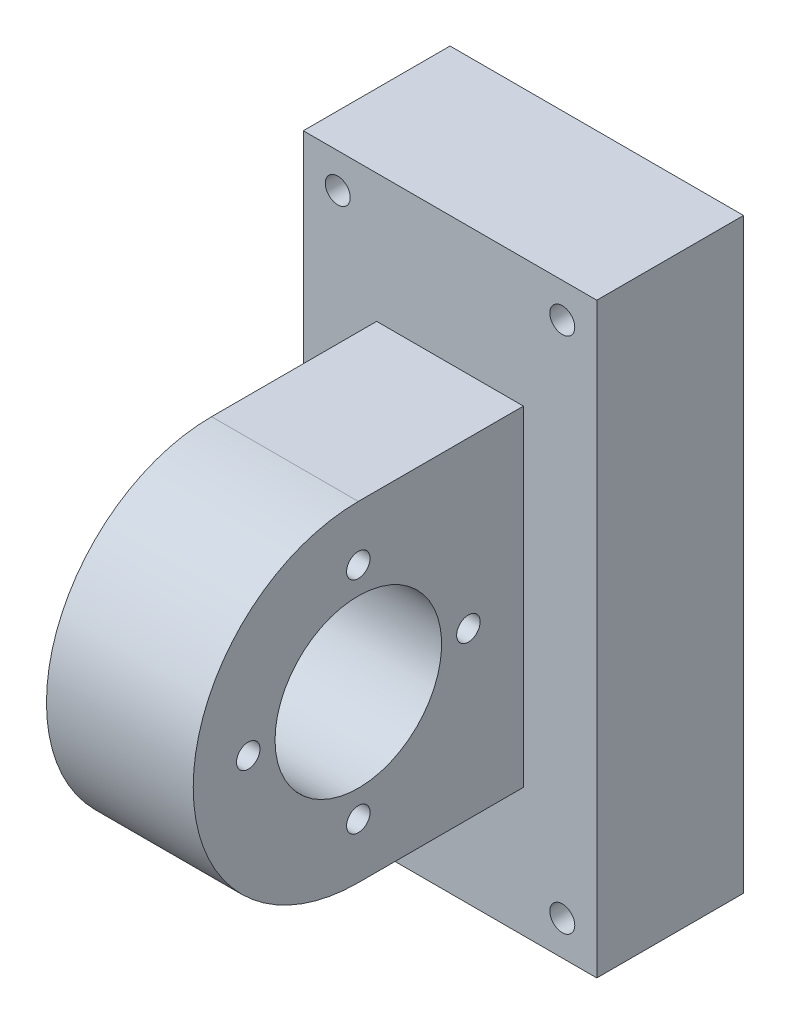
ISO-10303-21;
HEADER;
FILE_DESCRIPTION(('STEP AP214'),'2;1');
FILE_NAME('part.step','',(''),(''),'','','');
FILE_SCHEMA(('AUTOMOTIVE_DESIGN { 1 0 10303 214 1 1 1 1 }'));
ENDSEC;
DATA;
#1=APPLICATION_CONTEXT('core data for automotive mechanical design processes');
#2=APPLICATION_PROTOCOL_DEFINITION('international standard','automotive_design',2000,#1);
#3=PRODUCT_CONTEXT('',#1,'mechanical');
#4=PRODUCT('Part','Part','',(#3));
#5=PRODUCT_RELATED_PRODUCT_CATEGORY('part','',(#4));
#6=PRODUCT_DEFINITION_FORMATION('','',#4);
#7=PRODUCT_DEFINITION_CONTEXT('part definition',#1,'design');
#8=PRODUCT_DEFINITION('design','',#6,#7);
#9=PRODUCT_DEFINITION_SHAPE('','',#8);
#10=(LENGTH_UNIT() NAMED_UNIT(*) SI_UNIT(.MILLI.,.METRE.));
#11=(NAMED_UNIT(*) PLANE_ANGLE_UNIT() SI_UNIT($,.RADIAN.));
#12=(NAMED_UNIT(*) SI_UNIT($,.STERADIAN.) SOLID_ANGLE_UNIT());
#13=UNCERTAINTY_MEASURE_WITH_UNIT(LENGTH_MEASURE(1.E-05),#10,'distance_accuracy_value','');
#14=(GEOMETRIC_REPRESENTATION_CONTEXT(3) GLOBAL_UNCERTAINTY_ASSIGNED_CONTEXT((#13)) GLOBAL_UNIT_ASSIGNED_CONTEXT((#10,
#11,#12)) REPRESENTATION_CONTEXT('',''));
#15=CARTESIAN_POINT('',(0.,0.,0.));
#16=DIRECTION('',(0.,0.,1.));
#17=DIRECTION('',(1.,0.,0.));
#18=AXIS2_PLACEMENT_3D('',#15,#16,#17);
#19=CARTESIAN_POINT('',(0.,0.,20.));
#20=DIRECTION('',(0.,0.,-1.));
#21=DIRECTION('',(-1.,0.,0.));
#22=AXIS2_PLACEMENT_3D('',#19,#20,#21);
#23=PLANE('',#22);
#24=DIRECTION('',(0.,1.,0.));
#25=VECTOR('',#24,1.);
#26=CARTESIAN_POINT('',(10.,-40.,20.));
#27=LINE('',#26,#25);
#28=CARTESIAN_POINT('',(10.,-40.,20.));
#29=VERTEX_POINT('',#28);
#30=CARTESIAN_POINT('',(10.,40.,20.));
#31=VERTEX_POINT('',#30);
#32=EDGE_CURVE('E84',#29,#31,#27,.T.);
#33=ORIENTED_EDGE('',*,*,#32,.T.);
#34=DIRECTION('',(-1.,0.,0.));
#35=VECTOR('',#34,1.);
#36=CARTESIAN_POINT('',(-10.,40.,20.));
#37=LINE('',#36,#35);
#38=CARTESIAN_POINT('',(-30.,40.,20.));
#39=VERTEX_POINT('',#38);
#40=EDGE_CURVE('E101',#31,#39,#37,.T.);
#41=ORIENTED_EDGE('',*,*,#40,.T.);
#42=DIRECTION('',(0.,1.,0.));
#43=VECTOR('',#42,1.);
#44=CARTESIAN_POINT('',(-30.,-40.,20.));
#45=LINE('',#44,#43);
#46=CARTESIAN_POINT('',(-30.,-40.,20.));
#47=VERTEX_POINT('',#46);
#48=EDGE_CURVE('E117',#47,#39,#45,.T.);
#49=ORIENTED_EDGE('',*,*,#48,.F.);
#50=DIRECTION('',(1.,0.,0.));
#51=VECTOR('',#50,1.);
#52=CARTESIAN_POINT('',(-10.,-40.,20.));
#53=LINE('',#52,#51);
#54=EDGE_CURVE('E59',#47,#29,#53,.T.);
#55=ORIENTED_EDGE('',*,*,#54,.T.);
#56=EDGE_LOOP('',(#33,#41,#49,#55));
#57=FACE_BOUND('',#56,.T.);
#58=CARTESIAN_POINT('',(5.3,35.3,20.));
#59=DIRECTION('',(0.,0.,1.));
#60=DIRECTION('',(1.,0.,0.));
#61=AXIS2_PLACEMENT_3D('',#58,#59,#60);
#62=CIRCLE('',#61,1.7);
#63=CARTESIAN_POINT('',(7.,35.3,20.));
#64=VERTEX_POINT('',#63);
#65=EDGE_CURVE('E97',#64,#64,#62,.T.);
#66=ORIENTED_EDGE('',*,*,#65,.F.);
#67=EDGE_LOOP('',(#66));
#68=FACE_BOUND('',#67,.T.);
#69=CARTESIAN_POINT('',(5.3,-35.3,20.));
#70=DIRECTION('',(0.,0.,-1.));
#71=DIRECTION('',(1.,0.,0.));
#72=AXIS2_PLACEMENT_3D('',#69,#70,#71);
#73=CIRCLE('',#72,1.7);
#74=CARTESIAN_POINT('',(7.,-35.3,20.));
#75=VERTEX_POINT('',#74);
#76=EDGE_CURVE('E108',#75,#75,#73,.T.);
#77=ORIENTED_EDGE('',*,*,#76,.T.);
#78=EDGE_LOOP('',(#77));
#79=FACE_BOUND('',#78,.T.);
#80=CARTESIAN_POINT('',(-25.3,-35.3,20.));
#81=DIRECTION('',(0.,0.,1.));
#82=DIRECTION('',(-1.,0.,0.));
#83=AXIS2_PLACEMENT_3D('',#80,#81,#82);
#84=CIRCLE('',#83,1.7);
#85=CARTESIAN_POINT('',(-27.,-35.3,20.));
#86=VERTEX_POINT('',#85);
#87=EDGE_CURVE('E123',#86,#86,#84,.T.);
#88=ORIENTED_EDGE('',*,*,#87,.F.);
#89=EDGE_LOOP('',(#88));
#90=FACE_BOUND('',#89,.T.);
#91=CARTESIAN_POINT('',(-25.3,35.3,20.));
#92=DIRECTION('',(0.,0.,-1.));
#93=DIRECTION('',(-1.,0.,0.));
#94=AXIS2_PLACEMENT_3D('',#91,#92,#93);
#95=CIRCLE('',#94,1.7);
#96=CARTESIAN_POINT('',(-27.,35.3,20.));
#97=VERTEX_POINT('',#96);
#98=EDGE_CURVE('E129',#97,#97,#95,.T.);
#99=ORIENTED_EDGE('',*,*,#98,.T.);
#100=EDGE_LOOP('',(#99));
#101=FACE_BOUND('',#100,.T.);
#102=DIRECTION('',(0.,1.,0.));
#103=VECTOR('',#102,1.);
#104=CARTESIAN_POINT('',(0.,0.,20.));
#105=LINE('',#104,#103);
#106=CARTESIAN_POINT('',(0.,-22.5,20.));
#107=VERTEX_POINT('',#106);
#108=CARTESIAN_POINT('',(0.,22.5,20.));
#109=VERTEX_POINT('',#108);
#110=EDGE_CURVE('E157',#107,#109,#105,.T.);
#111=ORIENTED_EDGE('',*,*,#110,.F.);
#112=DIRECTION('',(-1.,0.,0.));
#113=VECTOR('',#112,1.);
#114=CARTESIAN_POINT('',(0.,-22.5,20.));
#115=LINE('',#114,#113);
#116=CARTESIAN_POINT('',(-20.,-22.5,20.));
#117=VERTEX_POINT('',#116);
#118=EDGE_CURVE('E135',#107,#117,#115,.T.);
#119=ORIENTED_EDGE('',*,*,#118,.T.);
#120=DIRECTION('',(0.,1.,0.));
#121=VECTOR('',#120,1.);
#122=CARTESIAN_POINT('',(-20.,0.,20.));
#123=LINE('',#122,#121);
#124=CARTESIAN_POINT('',(-20.,22.5,20.));
#125=VERTEX_POINT('',#124);
#126=EDGE_CURVE('E169',#117,#125,#123,.T.);
#127=ORIENTED_EDGE('',*,*,#126,.T.);
#128=DIRECTION('',(-1.,0.,0.));
#129=VECTOR('',#128,1.);
#130=CARTESIAN_POINT('',(0.,22.5,20.));
#131=LINE('',#130,#129);
#132=EDGE_CURVE('E132',#109,#125,#131,.T.);
#133=ORIENTED_EDGE('',*,*,#132,.F.);
#134=EDGE_LOOP('',(#111,#119,#127,#133));
#135=FACE_BOUND('',#134,.T.);
#136=ADVANCED_FACE('F35',(#57,#68,#79,#90,#101,#135),#23,.F.);
#137=CARTESIAN_POINT('',(10.,-40.,20.));
#138=DIRECTION('',(-1.,0.,0.));
#139=DIRECTION('',(0.,0.,1.));
#140=AXIS2_PLACEMENT_3D('',#137,#138,#139);
#141=PLANE('',#140);
#142=DIRECTION('',(0.,1.,0.));
#143=VECTOR('',#142,1.);
#144=CARTESIAN_POINT('',(10.,-40.,0.));
#145=LINE('',#144,#143);
#146=CARTESIAN_POINT('',(10.,-40.,0.));
#147=VERTEX_POINT('',#146);
#148=CARTESIAN_POINT('',(10.,40.,0.));
#149=VERTEX_POINT('',#148);
#150=EDGE_CURVE('E90',#147,#149,#145,.T.);
#151=ORIENTED_EDGE('',*,*,#150,.T.);
#152=DIRECTION('',(0.,0.,-1.));
#153=VECTOR('',#152,1.);
#154=CARTESIAN_POINT('',(10.,40.,20.));
#155=LINE('',#154,#153);
#156=EDGE_CURVE('E11',#31,#149,#155,.T.);
#157=ORIENTED_EDGE('',*,*,#156,.F.);
#158=ORIENTED_EDGE('',*,*,#32,.F.);
#159=DIRECTION('',(0.,0.,-1.));
#160=VECTOR('',#159,1.);
#161=CARTESIAN_POINT('',(10.,-40.,20.));
#162=LINE('',#161,#160);
#163=EDGE_CURVE('E43',#29,#147,#162,.T.);
#164=ORIENTED_EDGE('',*,*,#163,.T.);
#165=EDGE_LOOP('',(#151,#157,#158,#164));
#166=FACE_BOUND('',#165,.T.);
#167=ADVANCED_FACE('F37',(#166),#141,.F.);
#168=CARTESIAN_POINT('',(-10.,40.,20.));
#169=DIRECTION('',(0.,-1.,0.));
#170=DIRECTION('',(0.,0.,-1.));
#171=AXIS2_PLACEMENT_3D('',#168,#169,#170);
#172=PLANE('',#171);
#173=DIRECTION('',(-1.,0.,0.));
#174=VECTOR('',#173,1.);
#175=CARTESIAN_POINT('',(-10.,40.,0.));
#176=LINE('',#175,#174);
#177=CARTESIAN_POINT('',(-30.,40.,0.));
#178=VERTEX_POINT('',#177);
#179=EDGE_CURVE('E85',#149,#178,#176,.T.);
#180=ORIENTED_EDGE('',*,*,#179,.T.);
#181=DIRECTION('',(0.,0.,-1.));
#182=VECTOR('',#181,1.);
#183=CARTESIAN_POINT('',(-30.,40.,20.));
#184=LINE('',#183,#182);
#185=EDGE_CURVE('E114',#39,#178,#184,.T.);
#186=ORIENTED_EDGE('',*,*,#185,.F.);
#187=ORIENTED_EDGE('',*,*,#40,.F.);
#188=ORIENTED_EDGE('',*,*,#156,.T.);
#189=EDGE_LOOP('',(#180,#186,#187,#188));
#190=FACE_BOUND('',#189,.T.);
#191=ADVANCED_FACE('F244',(#190),#172,.F.);
#192=CARTESIAN_POINT('',(-10.,-40.,20.));
#193=DIRECTION('',(0.,1.,0.));
#194=DIRECTION('',(0.,0.,1.));
#195=AXIS2_PLACEMENT_3D('',#192,#193,#194);
#196=PLANE('',#195);
#197=DIRECTION('',(1.,0.,0.));
#198=VECTOR('',#197,1.);
#199=CARTESIAN_POINT('',(-10.,-40.,0.));
#200=LINE('',#199,#198);
#201=CARTESIAN_POINT('',(-30.,-40.,0.));
#202=VERTEX_POINT('',#201);
#203=EDGE_CURVE('E73',#202,#147,#200,.T.);
#204=ORIENTED_EDGE('',*,*,#203,.T.);
#205=ORIENTED_EDGE('',*,*,#163,.F.);
#206=ORIENTED_EDGE('',*,*,#54,.F.);
#207=DIRECTION('',(0.,0.,-1.));
#208=VECTOR('',#207,1.);
#209=CARTESIAN_POINT('',(-30.,-40.,20.));
#210=LINE('',#209,#208);
#211=EDGE_CURVE('E79',#47,#202,#210,.T.);
#212=ORIENTED_EDGE('',*,*,#211,.T.);
#213=EDGE_LOOP('',(#204,#205,#206,#212));
#214=FACE_BOUND('',#213,.T.);
#215=ADVANCED_FACE('F75',(#214),#196,.F.);
#216=CARTESIAN_POINT('',(0.,0.,0.));
#217=DIRECTION('',(0.,0.,-1.));
#218=DIRECTION('',(-1.,0.,0.));
#219=AXIS2_PLACEMENT_3D('',#216,#217,#218);
#220=PLANE('',#219);
#221=CARTESIAN_POINT('',(-25.3,35.3,0.));
#222=DIRECTION('',(0.,0.,-1.));
#223=DIRECTION('',(-1.,0.,0.));
#224=AXIS2_PLACEMENT_3D('',#221,#222,#223);
#225=CIRCLE('',#224,1.7);
#226=CARTESIAN_POINT('',(-27.,35.3,0.));
#227=VERTEX_POINT('',#226);
#228=EDGE_CURVE('E126',#227,#227,#225,.T.);
#229=ORIENTED_EDGE('',*,*,#228,.F.);
#230=EDGE_LOOP('',(#229));
#231=FACE_BOUND('',#230,.T.);
#232=CARTESIAN_POINT('',(-25.3,-35.3,0.));
#233=DIRECTION('',(0.,0.,1.));
#234=DIRECTION('',(-1.,0.,0.));
#235=AXIS2_PLACEMENT_3D('',#232,#233,#234);
#236=CIRCLE('',#235,1.7);
#237=CARTESIAN_POINT('',(-27.,-35.3,0.));
#238=VERTEX_POINT('',#237);
#239=EDGE_CURVE('E120',#238,#238,#236,.T.);
#240=ORIENTED_EDGE('',*,*,#239,.T.);
#241=EDGE_LOOP('',(#240));
#242=FACE_BOUND('',#241,.T.);
#243=CARTESIAN_POINT('',(5.3,-35.3,0.));
#244=DIRECTION('',(0.,0.,-1.));
#245=DIRECTION('',(1.,0.,0.));
#246=AXIS2_PLACEMENT_3D('',#243,#244,#245);
#247=CIRCLE('',#246,1.7);
#248=CARTESIAN_POINT('',(7.,-35.3,0.));
#249=VERTEX_POINT('',#248);
#250=EDGE_CURVE('E106',#249,#249,#247,.T.);
#251=ORIENTED_EDGE('',*,*,#250,.F.);
#252=EDGE_LOOP('',(#251));
#253=FACE_BOUND('',#252,.T.);
#254=CARTESIAN_POINT('',(5.3,35.3,0.));
#255=DIRECTION('',(0.,0.,1.));
#256=DIRECTION('',(1.,0.,0.));
#257=AXIS2_PLACEMENT_3D('',#254,#255,#256);
#258=CIRCLE('',#257,1.7);
#259=CARTESIAN_POINT('',(7.,35.3,0.));
#260=VERTEX_POINT('',#259);
#261=EDGE_CURVE('E93',#260,#260,#258,.T.);
#262=ORIENTED_EDGE('',*,*,#261,.T.);
#263=EDGE_LOOP('',(#262));
#264=FACE_BOUND('',#263,.T.);
#265=ORIENTED_EDGE('',*,*,#150,.F.);
#266=ORIENTED_EDGE('',*,*,#203,.F.);
#267=DIRECTION('',(0.,1.,0.));
#268=VECTOR('',#267,1.);
#269=CARTESIAN_POINT('',(-30.,-40.,0.));
#270=LINE('',#269,#268);
#271=EDGE_CURVE('E118',#202,#178,#270,.T.);
#272=ORIENTED_EDGE('',*,*,#271,.T.);
#273=ORIENTED_EDGE('',*,*,#179,.F.);
#274=EDGE_LOOP('',(#265,#266,#272,#273));
#275=FACE_BOUND('',#274,.T.);
#276=ADVANCED_FACE('F91',(#231,#242,#253,#264,#275),#220,.T.);
#277=CARTESIAN_POINT('',(5.3,35.3,0.));
#278=DIRECTION('',(0.,0.,1.));
#279=DIRECTION('',(1.,0.,0.));
#280=AXIS2_PLACEMENT_3D('',#277,#278,#279);
#281=CYLINDRICAL_SURFACE('',#280,1.7);
#282=ORIENTED_EDGE('',*,*,#261,.F.);
#283=EDGE_LOOP('',(#282));
#284=FACE_BOUND('',#283,.T.);
#285=ORIENTED_EDGE('',*,*,#65,.T.);
#286=EDGE_LOOP('',(#285));
#287=FACE_BOUND('',#286,.T.);
#288=ADVANCED_FACE('F248',(#284,#287),#281,.F.);
#289=CARTESIAN_POINT('',(5.3,-35.3,0.));
#290=DIRECTION('',(0.,0.,1.));
#291=DIRECTION('',(1.,0.,0.));
#292=AXIS2_PLACEMENT_3D('',#289,#290,#291);
#293=CYLINDRICAL_SURFACE('',#292,1.7);
#294=ORIENTED_EDGE('',*,*,#250,.T.);
#295=EDGE_LOOP('',(#294));
#296=FACE_BOUND('',#295,.T.);
#297=ORIENTED_EDGE('',*,*,#76,.F.);
#298=EDGE_LOOP('',(#297));
#299=FACE_BOUND('',#298,.T.);
#300=ADVANCED_FACE('F311',(#296,#299),#293,.F.);
#301=CARTESIAN_POINT('',(-30.,-40.,20.));
#302=DIRECTION('',(-1.,0.,0.));
#303=DIRECTION('',(0.,0.,1.));
#304=AXIS2_PLACEMENT_3D('',#301,#302,#303);
#305=PLANE('',#304);
#306=ORIENTED_EDGE('',*,*,#271,.F.);
#307=ORIENTED_EDGE('',*,*,#211,.F.);
#308=ORIENTED_EDGE('',*,*,#48,.T.);
#309=ORIENTED_EDGE('',*,*,#185,.T.);
#310=EDGE_LOOP('',(#306,#307,#308,#309));
#311=FACE_BOUND('',#310,.T.);
#312=ADVANCED_FACE('F262',(#311),#305,.T.);
#313=CARTESIAN_POINT('',(-25.3,-35.3,0.));
#314=DIRECTION('',(0.,0.,1.));
#315=DIRECTION('',(1.,0.,0.));
#316=AXIS2_PLACEMENT_3D('',#313,#314,#315);
#317=CYLINDRICAL_SURFACE('',#316,1.7);
#318=ORIENTED_EDGE('',*,*,#239,.F.);
#319=EDGE_LOOP('',(#318));
#320=FACE_BOUND('',#319,.T.);
#321=ORIENTED_EDGE('',*,*,#87,.T.);
#322=EDGE_LOOP('',(#321));
#323=FACE_BOUND('',#322,.T.);
#324=ADVANCED_FACE('F305',(#320,#323),#317,.F.);
#325=CARTESIAN_POINT('',(-25.3,35.3,0.));
#326=DIRECTION('',(0.,0.,1.));
#327=DIRECTION('',(1.,0.,0.));
#328=AXIS2_PLACEMENT_3D('',#325,#326,#327);
#329=CYLINDRICAL_SURFACE('',#328,1.7);
#330=ORIENTED_EDGE('',*,*,#228,.T.);
#331=EDGE_LOOP('',(#330));
#332=FACE_BOUND('',#331,.T.);
#333=ORIENTED_EDGE('',*,*,#98,.F.);
#334=EDGE_LOOP('',(#333));
#335=FACE_BOUND('',#334,.T.);
#336=ADVANCED_FACE('F300',(#332,#335),#329,.F.);
#337=CARTESIAN_POINT('',(0.,22.5,0.));
#338=DIRECTION('',(0.,1.,0.));
#339=DIRECTION('',(0.,0.,1.));
#340=AXIS2_PLACEMENT_3D('',#337,#338,#339);
#341=PLANE('',#340);
#342=ORIENTED_EDGE('',*,*,#132,.T.);
#343=DIRECTION('',(0.,0.,-1.));
#344=VECTOR('',#343,1.);
#345=CARTESIAN_POINT('',(-20.,22.5,0.));
#346=LINE('',#345,#344);
#347=CARTESIAN_POINT('',(-20.,22.5,42.5));
#348=VERTEX_POINT('',#347);
#349=EDGE_CURVE('E50',#348,#125,#346,.T.);
#350=ORIENTED_EDGE('',*,*,#349,.F.);
#351=DIRECTION('',(-1.,0.,0.));
#352=VECTOR('',#351,1.);
#353=CARTESIAN_POINT('',(0.,22.5,42.5));
#354=LINE('',#353,#352);
#355=CARTESIAN_POINT('',(0.,22.5,42.5));
#356=VERTEX_POINT('',#355);
#357=EDGE_CURVE('E142',#356,#348,#354,.T.);
#358=ORIENTED_EDGE('',*,*,#357,.F.);
#359=DIRECTION('',(0.,0.,-1.));
#360=VECTOR('',#359,1.);
#361=CARTESIAN_POINT('',(0.,22.5,0.));
#362=LINE('',#361,#360);
#363=EDGE_CURVE('E148',#356,#109,#362,.T.);
#364=ORIENTED_EDGE('',*,*,#363,.T.);
#365=EDGE_LOOP('',(#342,#350,#358,#364));
#366=FACE_BOUND('',#365,.T.);
#367=ADVANCED_FACE('F289',(#366),#341,.T.);
#368=CARTESIAN_POINT('',(0.,0.,42.5));
#369=DIRECTION('',(-1.,0.,0.));
#370=DIRECTION('',(0.,0.,1.));
#371=AXIS2_PLACEMENT_3D('',#368,#369,#370);
#372=CYLINDRICAL_SURFACE('',#371,22.5);
#373=ORIENTED_EDGE('',*,*,#357,.T.);
#374=CARTESIAN_POINT('',(-20.,0.,42.5));
#375=DIRECTION('',(-1.,0.,0.));
#376=DIRECTION('',(0.,0.,1.));
#377=AXIS2_PLACEMENT_3D('',#374,#375,#376);
#378=CIRCLE('',#377,22.5);
#379=CARTESIAN_POINT('',(-20.,-22.5,42.5));
#380=VERTEX_POINT('',#379);
#381=EDGE_CURVE('E164',#380,#348,#378,.T.);
#382=ORIENTED_EDGE('',*,*,#381,.F.);
#383=DIRECTION('',(-1.,0.,0.));
#384=VECTOR('',#383,1.);
#385=CARTESIAN_POINT('',(0.,-22.5,42.5));
#386=LINE('',#385,#384);
#387=CARTESIAN_POINT('',(0.,-22.5,42.5));
#388=VERTEX_POINT('',#387);
#389=EDGE_CURVE('E138',#388,#380,#386,.T.);
#390=ORIENTED_EDGE('',*,*,#389,.F.);
#391=CARTESIAN_POINT('',(0.,0.,42.5));
#392=DIRECTION('',(-1.,0.,0.));
#393=DIRECTION('',(0.,0.,1.));
#394=AXIS2_PLACEMENT_3D('',#391,#392,#393);
#395=CIRCLE('',#394,22.5);
#396=EDGE_CURVE('E151',#388,#356,#395,.T.);
#397=ORIENTED_EDGE('',*,*,#396,.T.);
#398=EDGE_LOOP('',(#373,#382,#390,#397));
#399=FACE_BOUND('',#398,.T.);
#400=ADVANCED_FACE('F292',(#399),#372,.T.);
#401=CARTESIAN_POINT('',(0.,-22.5,0.));
#402=DIRECTION('',(0.,1.,0.));
#403=DIRECTION('',(0.,0.,1.));
#404=AXIS2_PLACEMENT_3D('',#401,#402,#403);
#405=PLANE('',#404);
#406=ORIENTED_EDGE('',*,*,#389,.T.);
#407=DIRECTION('',(0.,0.,-1.));
#408=VECTOR('',#407,1.);
#409=CARTESIAN_POINT('',(-20.,-22.5,0.));
#410=LINE('',#409,#408);
#411=EDGE_CURVE('E166',#380,#117,#410,.T.);
#412=ORIENTED_EDGE('',*,*,#411,.T.);
#413=ORIENTED_EDGE('',*,*,#118,.F.);
#414=DIRECTION('',(0.,0.,-1.));
#415=VECTOR('',#414,1.);
#416=CARTESIAN_POINT('',(0.,-22.5,0.));
#417=LINE('',#416,#415);
#418=EDGE_CURVE('E154',#388,#107,#417,.T.);
#419=ORIENTED_EDGE('',*,*,#418,.F.);
#420=EDGE_LOOP('',(#406,#412,#413,#419));
#421=FACE_BOUND('',#420,.T.);
#422=ADVANCED_FACE('F226',(#421),#405,.F.);
#423=CARTESIAN_POINT('',(0.,0.,42.5));
#424=DIRECTION('',(-1.,0.,0.));
#425=DIRECTION('',(0.,0.,1.));
#426=AXIS2_PLACEMENT_3D('',#423,#424,#425);
#427=CYLINDRICAL_SURFACE('',#426,11.35);
#428=CARTESIAN_POINT('',(0.,0.,42.5));
#429=DIRECTION('',(-1.,0.,0.));
#430=DIRECTION('',(0.,0.,1.));
#431=AXIS2_PLACEMENT_3D('',#428,#429,#430);
#432=CIRCLE('',#431,11.35);
#433=CARTESIAN_POINT('',(0.,0.,53.85));
#434=VERTEX_POINT('',#433);
#435=EDGE_CURVE('E139',#434,#434,#432,.T.);
#436=ORIENTED_EDGE('',*,*,#435,.F.);
#437=EDGE_LOOP('',(#436));
#438=FACE_BOUND('',#437,.T.);
#439=CARTESIAN_POINT('',(-20.,0.,42.5));
#440=DIRECTION('',(-1.,0.,0.));
#441=DIRECTION('',(0.,0.,1.));
#442=AXIS2_PLACEMENT_3D('',#439,#440,#441);
#443=CIRCLE('',#442,11.35);
#444=CARTESIAN_POINT('',(-20.,0.,53.85));
#445=VERTEX_POINT('',#444);
#446=EDGE_CURVE('E160',#445,#445,#443,.T.);
#447=ORIENTED_EDGE('',*,*,#446,.T.);
#448=EDGE_LOOP('',(#447));
#449=FACE_BOUND('',#448,.T.);
#450=ADVANCED_FACE('F210',(#438,#449),#427,.F.);
#451=CARTESIAN_POINT('',(0.,0.,0.));
#452=DIRECTION('',(-1.,0.,0.));
#453=DIRECTION('',(0.,0.,1.));
#454=AXIS2_PLACEMENT_3D('',#451,#452,#453);
#455=PLANE('',#454);
#456=CARTESIAN_POINT('',(0.,0.,27.5));
#457=DIRECTION('',(1.,0.,0.));
#458=DIRECTION('',(0.,0.,1.));
#459=AXIS2_PLACEMENT_3D('',#456,#457,#458);
#460=CIRCLE('',#459,1.6);
#461=CARTESIAN_POINT('',(0.,0.,29.1));
#462=VERTEX_POINT('',#461);
#463=EDGE_CURVE('E191',#462,#462,#460,.T.);
#464=ORIENTED_EDGE('',*,*,#463,.F.);
#465=EDGE_LOOP('',(#464));
#466=FACE_BOUND('',#465,.T.);
#467=CARTESIAN_POINT('',(0.,-15.,42.5000000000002));
#468=DIRECTION('',(1.,0.,0.));
#469=DIRECTION('',(0.,1.,0.));
#470=AXIS2_PLACEMENT_3D('',#467,#468,#469);
#471=CIRCLE('',#470,1.6);
#472=CARTESIAN_POINT('',(0.,-13.4,42.5000000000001));
#473=VERTEX_POINT('',#472);
#474=EDGE_CURVE('E185',#473,#473,#471,.T.);
#475=ORIENTED_EDGE('',*,*,#474,.F.);
#476=EDGE_LOOP('',(#475));
#477=FACE_BOUND('',#476,.T.);
#478=CARTESIAN_POINT('',(0.,15.,42.5));
#479=DIRECTION('',(1.,0.,0.));
#480=DIRECTION('',(0.,-1.,0.));
#481=AXIS2_PLACEMENT_3D('',#478,#479,#480);
#482=CIRCLE('',#481,1.6);
#483=CARTESIAN_POINT('',(0.,13.4,42.5));
#484=VERTEX_POINT('',#483);
#485=EDGE_CURVE('E179',#484,#484,#482,.T.);
#486=ORIENTED_EDGE('',*,*,#485,.F.);
#487=EDGE_LOOP('',(#486));
#488=FACE_BOUND('',#487,.T.);
#489=CARTESIAN_POINT('',(0.,0.,57.5));
#490=DIRECTION('',(1.,0.,0.));
#491=DIRECTION('',(0.,0.,-1.));
#492=AXIS2_PLACEMENT_3D('',#489,#490,#491);
#493=CIRCLE('',#492,1.6);
#494=CARTESIAN_POINT('',(0.,0.,55.9));
#495=VERTEX_POINT('',#494);
#496=EDGE_CURVE('E173',#495,#495,#493,.T.);
#497=ORIENTED_EDGE('',*,*,#496,.F.);
#498=EDGE_LOOP('',(#497));
#499=FACE_BOUND('',#498,.T.);
#500=ORIENTED_EDGE('',*,*,#110,.T.);
#501=ORIENTED_EDGE('',*,*,#363,.F.);
#502=ORIENTED_EDGE('',*,*,#396,.F.);
#503=ORIENTED_EDGE('',*,*,#418,.T.);
#504=EDGE_LOOP('',(#500,#501,#502,#503));
#505=FACE_BOUND('',#504,.T.);
#506=ORIENTED_EDGE('',*,*,#435,.T.);
#507=EDGE_LOOP('',(#506));
#508=FACE_BOUND('',#507,.T.);
#509=ADVANCED_FACE('F207',(#466,#477,#488,#499,#505,#508),#455,.F.);
#510=CARTESIAN_POINT('',(-20.,0.,0.));
#511=DIRECTION('',(-1.,0.,0.));
#512=DIRECTION('',(0.,0.,1.));
#513=AXIS2_PLACEMENT_3D('',#510,#511,#512);
#514=PLANE('',#513);
#515=CARTESIAN_POINT('',(-20.,0.,27.5));
#516=DIRECTION('',(1.,0.,0.));
#517=DIRECTION('',(0.,0.,1.));
#518=AXIS2_PLACEMENT_3D('',#515,#516,#517);
#519=CIRCLE('',#518,1.6);
#520=CARTESIAN_POINT('',(-20.,0.,29.1));
#521=VERTEX_POINT('',#520);
#522=EDGE_CURVE('E182',#521,#521,#519,.T.);
#523=ORIENTED_EDGE('',*,*,#522,.T.);
#524=EDGE_LOOP('',(#523));
#525=FACE_BOUND('',#524,.T.);
#526=CARTESIAN_POINT('',(-20.,-15.,42.5000000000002));
#527=DIRECTION('',(1.,0.,0.));
#528=DIRECTION('',(0.,1.,0.));
#529=AXIS2_PLACEMENT_3D('',#526,#527,#528);
#530=CIRCLE('',#529,1.6);
#531=CARTESIAN_POINT('',(-20.,-13.4,42.5000000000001));
#532=VERTEX_POINT('',#531);
#533=EDGE_CURVE('E188',#532,#532,#530,.T.);
#534=ORIENTED_EDGE('',*,*,#533,.T.);
#535=EDGE_LOOP('',(#534));
#536=FACE_BOUND('',#535,.T.);
#537=CARTESIAN_POINT('',(-20.,15.,42.5));
#538=DIRECTION('',(1.,0.,0.));
#539=DIRECTION('',(0.,-1.,0.));
#540=AXIS2_PLACEMENT_3D('',#537,#538,#539);
#541=CIRCLE('',#540,1.6);
#542=CARTESIAN_POINT('',(-20.,13.4,42.5));
#543=VERTEX_POINT('',#542);
#544=EDGE_CURVE('E176',#543,#543,#541,.T.);
#545=ORIENTED_EDGE('',*,*,#544,.T.);
#546=EDGE_LOOP('',(#545));
#547=FACE_BOUND('',#546,.T.);
#548=CARTESIAN_POINT('',(-20.,0.,57.5));
#549=DIRECTION('',(1.,0.,0.));
#550=DIRECTION('',(0.,0.,-1.));
#551=AXIS2_PLACEMENT_3D('',#548,#549,#550);
#552=CIRCLE('',#551,1.6);
#553=CARTESIAN_POINT('',(-20.,0.,55.9));
#554=VERTEX_POINT('',#553);
#555=EDGE_CURVE('E172',#554,#554,#552,.T.);
#556=ORIENTED_EDGE('',*,*,#555,.T.);
#557=EDGE_LOOP('',(#556));
#558=FACE_BOUND('',#557,.T.);
#559=ORIENTED_EDGE('',*,*,#126,.F.);
#560=ORIENTED_EDGE('',*,*,#411,.F.);
#561=ORIENTED_EDGE('',*,*,#381,.T.);
#562=ORIENTED_EDGE('',*,*,#349,.T.);
#563=EDGE_LOOP('',(#559,#560,#561,#562));
#564=FACE_BOUND('',#563,.T.);
#565=ORIENTED_EDGE('',*,*,#446,.F.);
#566=EDGE_LOOP('',(#565));
#567=FACE_BOUND('',#566,.T.);
#568=ADVANCED_FACE('F197',(#525,#536,#547,#558,#564,#567),#514,.T.);
#569=CARTESIAN_POINT('',(-20.,0.,57.5));
#570=DIRECTION('',(1.,0.,0.));
#571=DIRECTION('',(0.,0.,-1.));
#572=AXIS2_PLACEMENT_3D('',#569,#570,#571);
#573=CYLINDRICAL_SURFACE('',#572,1.6);
#574=ORIENTED_EDGE('',*,*,#555,.F.);
#575=EDGE_LOOP('',(#574));
#576=FACE_BOUND('',#575,.T.);
#577=ORIENTED_EDGE('',*,*,#496,.T.);
#578=EDGE_LOOP('',(#577));
#579=FACE_BOUND('',#578,.T.);
#580=ADVANCED_FACE('F231',(#576,#579),#573,.F.);
#581=CARTESIAN_POINT('',(-20.,15.,42.5));
#582=DIRECTION('',(1.,0.,0.));
#583=DIRECTION('',(0.,0.,-1.));
#584=AXIS2_PLACEMENT_3D('',#581,#582,#583);
#585=CYLINDRICAL_SURFACE('',#584,1.6);
#586=ORIENTED_EDGE('',*,*,#544,.F.);
#587=EDGE_LOOP('',(#586));
#588=FACE_BOUND('',#587,.T.);
#589=ORIENTED_EDGE('',*,*,#485,.T.);
#590=EDGE_LOOP('',(#589));
#591=FACE_BOUND('',#590,.T.);
#592=ADVANCED_FACE('F236',(#588,#591),#585,.F.);
#593=CARTESIAN_POINT('',(-20.,-15.,42.5000000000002));
#594=DIRECTION('',(1.,0.,0.));
#595=DIRECTION('',(0.,0.,-1.));
#596=AXIS2_PLACEMENT_3D('',#593,#594,#595);
#597=CYLINDRICAL_SURFACE('',#596,1.6);
#598=ORIENTED_EDGE('',*,*,#533,.F.);
#599=EDGE_LOOP('',(#598));
#600=FACE_BOUND('',#599,.T.);
#601=ORIENTED_EDGE('',*,*,#474,.T.);
#602=EDGE_LOOP('',(#601));
#603=FACE_BOUND('',#602,.T.);
#604=ADVANCED_FACE('F203',(#600,#603),#597,.F.);
#605=CARTESIAN_POINT('',(-20.,0.,27.5));
#606=DIRECTION('',(1.,0.,0.));
#607=DIRECTION('',(0.,0.,-1.));
#608=AXIS2_PLACEMENT_3D('',#605,#606,#607);
#609=CYLINDRICAL_SURFACE('',#608,1.6);
#610=ORIENTED_EDGE('',*,*,#522,.F.);
#611=EDGE_LOOP('',(#610));
#612=FACE_BOUND('',#611,.T.);
#613=ORIENTED_EDGE('',*,*,#463,.T.);
#614=EDGE_LOOP('',(#613));
#615=FACE_BOUND('',#614,.T.);
#616=ADVANCED_FACE('F200',(#612,#615),#609,.F.);
#617=CLOSED_SHELL('',(#136,#167,#191,#215,#276,#288,#300,#312,#324,#336,#367,#400,#422,#450,
#509,#568,#580,#592,#604,#616));
#618=MANIFOLD_SOLID_BREP('B2',#617);
#619=ADVANCED_BREP_SHAPE_REPRESENTATION('',(#18,#618),#14);
#620=SHAPE_DEFINITION_REPRESENTATION(#9,#619);
ENDSEC;
END-ISO-10303-21;
